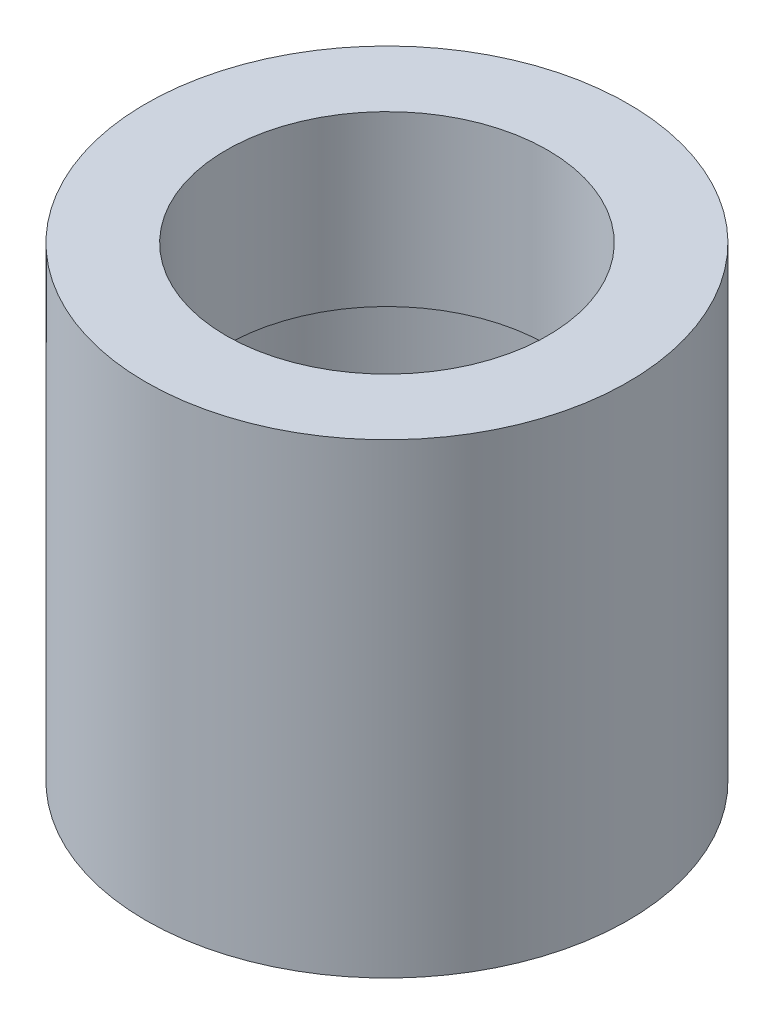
from build123d import *

# Parameters (mm, degrees)
SKETCH1_R           = 15
SKETCH1_R_2         = 13
BOSS_EXTRUDE1_DEPTH = 14.5
BOSS_EXTRUDE2_START = -10.5
SKETCH3_R           = 13
SKETCH3_R_2         = 10
BOSS_EXTRUDE2_DEPTH = 10.5


with BuildPart() as part:
    # Sketch1 → Boss-Extrude1 (new, symmetric)
    with BuildSketch(Plane(origin=(0, 0, 0), x_dir=(1, 0, 0), z_dir=(0, 1, 0))):
        with Locations(Location((0, 0, 0), (0, 0, 270))):
            Circle(SKETCH1_R)
        with Locations(Location((0, 0, 0), (0, 0, 270))):
            Circle(SKETCH1_R_2, mode=Mode.SUBTRACT)
    extrude(amount=BOSS_EXTRUDE1_DEPTH, both=True)

    # Sketch3 → Boss-Extrude2 (add)
    with BuildSketch(Plane(origin=(0, 14.5, 0), x_dir=(1, 0, 0), z_dir=(0, 1, 0)).offset(BOSS_EXTRUDE2_START)):
        with Locations(Location((0, 0, 0), (0, 0, 270))):
            Circle(SKETCH3_R)
        with Locations(Location((0, 0, 0), (0, 0, 270))):
            Circle(SKETCH3_R_2, mode=Mode.SUBTRACT)
    extrude(amount=BOSS_EXTRUDE2_DEPTH)


solid = part.part
